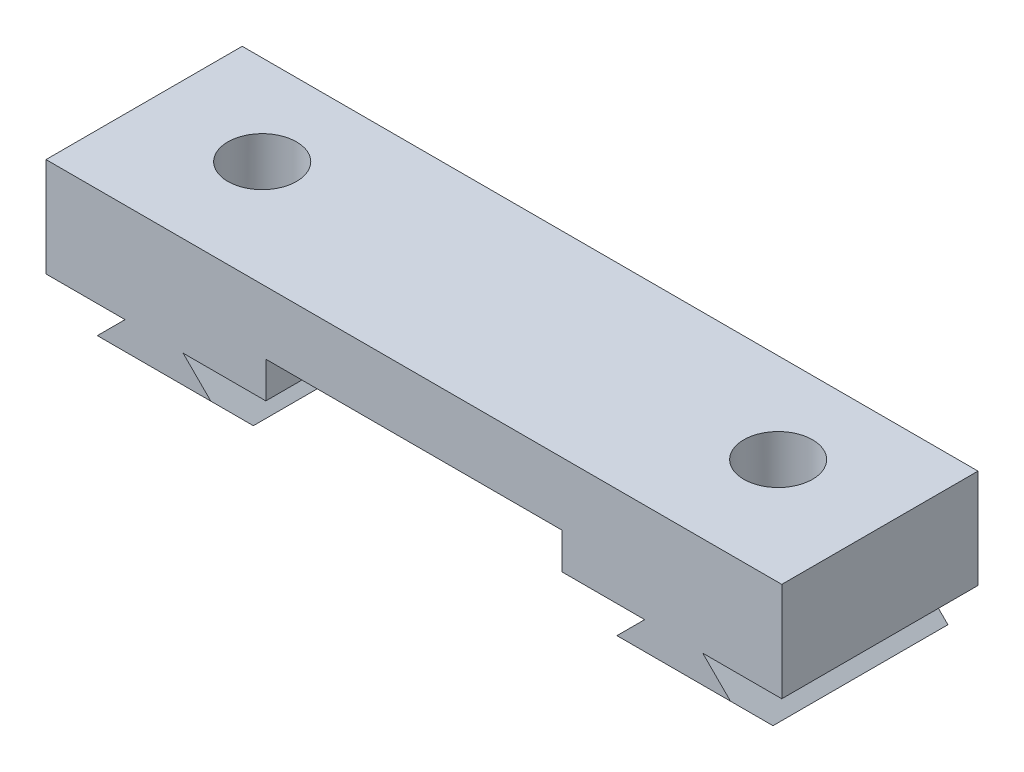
ISO-10303-21;
HEADER;
FILE_DESCRIPTION(('STEP AP214'),'2;1');
FILE_NAME('part.step','',(''),(''),'','','');
FILE_SCHEMA(('AUTOMOTIVE_DESIGN { 1 0 10303 214 1 1 1 1 }'));
ENDSEC;
DATA;
#1=APPLICATION_CONTEXT('core data for automotive mechanical design processes');
#2=APPLICATION_PROTOCOL_DEFINITION('international standard','automotive_design',2000,#1);
#3=PRODUCT_CONTEXT('',#1,'mechanical');
#4=PRODUCT('Part','Part','',(#3));
#5=PRODUCT_RELATED_PRODUCT_CATEGORY('part','',(#4));
#6=PRODUCT_DEFINITION_FORMATION('','',#4);
#7=PRODUCT_DEFINITION_CONTEXT('part definition',#1,'design');
#8=PRODUCT_DEFINITION('design','',#6,#7);
#9=PRODUCT_DEFINITION_SHAPE('','',#8);
#10=(LENGTH_UNIT() NAMED_UNIT(*) SI_UNIT(.MILLI.,.METRE.));
#11=(NAMED_UNIT(*) PLANE_ANGLE_UNIT() SI_UNIT($,.RADIAN.));
#12=(NAMED_UNIT(*) SI_UNIT($,.STERADIAN.) SOLID_ANGLE_UNIT());
#13=UNCERTAINTY_MEASURE_WITH_UNIT(LENGTH_MEASURE(1.E-05),#10,'distance_accuracy_value','');
#14=(GEOMETRIC_REPRESENTATION_CONTEXT(3) GLOBAL_UNCERTAINTY_ASSIGNED_CONTEXT((#13)) GLOBAL_UNIT_ASSIGNED_CONTEXT((#10,
#11,#12)) REPRESENTATION_CONTEXT('',''));
#15=CARTESIAN_POINT('',(0.,0.,0.));
#16=DIRECTION('',(0.,0.,1.));
#17=DIRECTION('',(1.,0.,0.));
#18=AXIS2_PLACEMENT_3D('',#15,#16,#17);
#19=CARTESIAN_POINT('',(-22.5,3.85,77.5));
#20=DIRECTION('',(0.,0.,-1.));
#21=DIRECTION('',(-1.,0.,0.));
#22=AXIS2_PLACEMENT_3D('',#19,#20,#21);
#23=PLANE('',#22);
#24=DIRECTION('',(1.,0.,0.));
#25=VECTOR('',#24,1.);
#26=CARTESIAN_POINT('',(0.,-2.21000000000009,77.5));
#27=LINE('',#26,#25);
#28=CARTESIAN_POINT('',(9.05487804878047,-2.20999999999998,77.5));
#29=VERTEX_POINT('',#28);
#30=CARTESIAN_POINT('',(14.1149885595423,-2.20999999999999,77.5));
#31=VERTEX_POINT('',#30);
#32=EDGE_CURVE('E266',#29,#31,#27,.T.);
#33=ORIENTED_EDGE('',*,*,#32,.T.);
#34=DIRECTION('',(0.707106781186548,0.707106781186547,0.));
#35=VECTOR('',#34,1.);
#36=CARTESIAN_POINT('',(14.1149885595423,-2.20999999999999,77.5));
#37=LINE('',#36,#35);
#38=CARTESIAN_POINT('',(12.4182904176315,-3.90669814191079,77.5));
#39=VERTEX_POINT('',#38);
#40=EDGE_CURVE('E283',#39,#31,#37,.T.);
#41=ORIENTED_EDGE('',*,*,#40,.F.);
#42=DIRECTION('',(1.,0.,0.));
#43=VECTOR('',#42,1.);
#44=CARTESIAN_POINT('',(21.7245960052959,-3.90669814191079,77.5));
#45=LINE('',#44,#43);
#46=CARTESIAN_POINT('',(19.3611836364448,-3.90669814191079,77.5));
#47=VERTEX_POINT('',#46);
#48=EDGE_CURVE('E419',#39,#47,#45,.T.);
#49=ORIENTED_EDGE('',*,*,#48,.T.);
#50=DIRECTION('',(0.707106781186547,-0.707106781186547,0.));
#51=VECTOR('',#50,1.);
#52=CARTESIAN_POINT('',(17.664485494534,-2.20999999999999,77.5));
#53=LINE('',#52,#51);
#54=CARTESIAN_POINT('',(17.664485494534,-2.20999999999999,77.5));
#55=VERTEX_POINT('',#54);
#56=EDGE_CURVE('E288',#55,#47,#53,.T.);
#57=ORIENTED_EDGE('',*,*,#56,.F.);
#58=DIRECTION('',(1.,0.,0.));
#59=VECTOR('',#58,1.);
#60=CARTESIAN_POINT('',(0.,-2.21,77.5));
#61=LINE('',#60,#59);
#62=CARTESIAN_POINT('',(22.5,-2.21,77.5));
#63=VERTEX_POINT('',#62);
#64=EDGE_CURVE('E343',#55,#63,#61,.T.);
#65=ORIENTED_EDGE('',*,*,#64,.T.);
#66=DIRECTION('',(0.,-1.,0.));
#67=VECTOR('',#66,1.);
#68=CARTESIAN_POINT('',(22.5,3.85,77.5));
#69=LINE('',#68,#67);
#70=CARTESIAN_POINT('',(22.5,3.85,77.5));
#71=VERTEX_POINT('',#70);
#72=EDGE_CURVE('E409',#71,#63,#69,.T.);
#73=ORIENTED_EDGE('',*,*,#72,.F.);
#74=DIRECTION('',(1.,0.,0.));
#75=VECTOR('',#74,1.);
#76=CARTESIAN_POINT('',(-22.5,3.85,77.5));
#77=LINE('',#76,#75);
#78=CARTESIAN_POINT('',(-22.5,3.85,77.5));
#79=VERTEX_POINT('',#78);
#80=EDGE_CURVE('E127',#79,#71,#77,.T.);
#81=ORIENTED_EDGE('',*,*,#80,.F.);
#82=DIRECTION('',(0.,-1.,0.));
#83=VECTOR('',#82,1.);
#84=CARTESIAN_POINT('',(-22.5,3.85,77.5));
#85=LINE('',#84,#83);
#86=CARTESIAN_POINT('',(-22.5,-2.20999999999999,77.5));
#87=VERTEX_POINT('',#86);
#88=EDGE_CURVE('E412',#79,#87,#85,.T.);
#89=ORIENTED_EDGE('',*,*,#88,.T.);
#90=DIRECTION('',(-1.,0.,0.));
#91=VECTOR('',#90,1.);
#92=CARTESIAN_POINT('',(0.,-2.21,77.5));
#93=LINE('',#92,#91);
#94=CARTESIAN_POINT('',(-17.664485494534,-2.20999999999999,77.5));
#95=VERTEX_POINT('',#94);
#96=EDGE_CURVE('E119',#95,#87,#93,.T.);
#97=ORIENTED_EDGE('',*,*,#96,.F.);
#98=DIRECTION('',(0.707106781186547,0.707106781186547,0.));
#99=VECTOR('',#98,1.);
#100=CARTESIAN_POINT('',(-17.664485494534,-2.20999999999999,77.5));
#101=LINE('',#100,#99);
#102=CARTESIAN_POINT('',(-19.3611836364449,-3.90669814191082,77.5));
#103=VERTEX_POINT('',#102);
#104=EDGE_CURVE('E308',#103,#95,#101,.T.);
#105=ORIENTED_EDGE('',*,*,#104,.F.);
#106=DIRECTION('',(1.,0.,0.));
#107=VECTOR('',#106,1.);
#108=CARTESIAN_POINT('',(-10.0548780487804,-3.90669814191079,77.5));
#109=LINE('',#108,#107);
#110=CARTESIAN_POINT('',(-12.4182904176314,-3.90669814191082,77.5));
#111=VERTEX_POINT('',#110);
#112=EDGE_CURVE('E416',#103,#111,#109,.T.);
#113=ORIENTED_EDGE('',*,*,#112,.T.);
#114=DIRECTION('',(0.707106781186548,-0.707106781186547,0.));
#115=VECTOR('',#114,1.);
#116=CARTESIAN_POINT('',(-14.1149885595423,-2.20999999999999,77.5));
#117=LINE('',#116,#115);
#118=CARTESIAN_POINT('',(-14.1149885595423,-2.20999999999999,77.5));
#119=VERTEX_POINT('',#118);
#120=EDGE_CURVE('E313',#119,#111,#117,.T.);
#121=ORIENTED_EDGE('',*,*,#120,.F.);
#122=DIRECTION('',(-1.,0.,0.));
#123=VECTOR('',#122,1.);
#124=CARTESIAN_POINT('',(0.,-2.21000000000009,77.5));
#125=LINE('',#124,#123);
#126=CARTESIAN_POINT('',(-9.0548780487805,-2.20999999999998,77.5));
#127=VERTEX_POINT('',#126);
#128=EDGE_CURVE('E359',#127,#119,#125,.T.);
#129=ORIENTED_EDGE('',*,*,#128,.F.);
#130=DIRECTION('',(0.,-1.,0.));
#131=VECTOR('',#130,1.);
#132=CARTESIAN_POINT('',(-9.05487804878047,3.85,77.5));
#133=LINE('',#132,#131);
#134=CARTESIAN_POINT('',(-9.05487804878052,0.,77.5));
#135=VERTEX_POINT('',#134);
#136=EDGE_CURVE('E373',#135,#127,#133,.T.);
#137=ORIENTED_EDGE('',*,*,#136,.F.);
#138=DIRECTION('',(-1.,0.,0.));
#139=VECTOR('',#138,1.);
#140=CARTESIAN_POINT('',(-9.05487804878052,0.,77.5));
#141=LINE('',#140,#139);
#142=CARTESIAN_POINT('',(9.05487804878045,0.,77.5));
#143=VERTEX_POINT('',#142);
#144=EDGE_CURVE('E388',#143,#135,#141,.T.);
#145=ORIENTED_EDGE('',*,*,#144,.F.);
#146=DIRECTION('',(0.,1.,0.));
#147=VECTOR('',#146,1.);
#148=CARTESIAN_POINT('',(9.05487804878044,-3.30669814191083,77.5));
#149=LINE('',#148,#147);
#150=EDGE_CURVE('E371',#29,#143,#149,.T.);
#151=ORIENTED_EDGE('',*,*,#150,.F.);
#152=EDGE_LOOP('',(#33,#41,#49,#57,#65,#73,#81,#89,#97,#105,#113,#121,#129,#137,#145,#151));
#153=FACE_BOUND('',#152,.T.);
#154=ADVANCED_FACE('F104',(#153),#23,.F.);
#155=CARTESIAN_POINT('',(22.5,7.58552377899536,65.5));
#156=DIRECTION('',(0.,0.,1.));
#157=DIRECTION('',(1.,0.,0.));
#158=AXIS2_PLACEMENT_3D('',#155,#156,#157);
#159=PLANE('',#158);
#160=DIRECTION('',(0.707106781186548,0.707106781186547,0.));
#161=VECTOR('',#160,1.);
#162=CARTESIAN_POINT('',(14.1149885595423,-2.20999999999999,65.5));
#163=LINE('',#162,#161);
#164=CARTESIAN_POINT('',(11.1182904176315,-5.2066981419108,65.5));
#165=VERTEX_POINT('',#164);
#166=CARTESIAN_POINT('',(14.1149885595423,-2.20999999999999,65.5));
#167=VERTEX_POINT('',#166);
#168=EDGE_CURVE('E285',#165,#167,#163,.T.);
#169=ORIENTED_EDGE('',*,*,#168,.T.);
#170=DIRECTION('',(1.,0.,0.));
#171=VECTOR('',#170,1.);
#172=CARTESIAN_POINT('',(0.,-2.21000000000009,65.5));
#173=LINE('',#172,#171);
#174=CARTESIAN_POINT('',(9.05487804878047,-2.20999999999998,65.5));
#175=VERTEX_POINT('',#174);
#176=EDGE_CURVE('E265',#175,#167,#173,.T.);
#177=ORIENTED_EDGE('',*,*,#176,.F.);
#178=DIRECTION('',(0.,1.,0.));
#179=VECTOR('',#178,1.);
#180=CARTESIAN_POINT('',(9.05487804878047,3.85,65.5));
#181=LINE('',#180,#179);
#182=CARTESIAN_POINT('',(9.05487804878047,0.,65.5));
#183=VERTEX_POINT('',#182);
#184=EDGE_CURVE('E378',#175,#183,#181,.T.);
#185=ORIENTED_EDGE('',*,*,#184,.T.);
#186=DIRECTION('',(1.,0.,0.));
#187=VECTOR('',#186,1.);
#188=CARTESIAN_POINT('',(-9.05487804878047,0.,65.5));
#189=LINE('',#188,#187);
#190=CARTESIAN_POINT('',(-9.05487804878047,0.,65.5));
#191=VERTEX_POINT('',#190);
#192=EDGE_CURVE('E367',#191,#183,#189,.T.);
#193=ORIENTED_EDGE('',*,*,#192,.F.);
#194=DIRECTION('',(0.,-1.,0.));
#195=VECTOR('',#194,1.);
#196=CARTESIAN_POINT('',(-9.05487804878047,3.85,65.5));
#197=LINE('',#196,#195);
#198=CARTESIAN_POINT('',(-9.05487804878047,-2.20999999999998,65.5));
#199=VERTEX_POINT('',#198);
#200=EDGE_CURVE('E385',#191,#199,#197,.T.);
#201=ORIENTED_EDGE('',*,*,#200,.T.);
#202=DIRECTION('',(-1.,0.,0.));
#203=VECTOR('',#202,1.);
#204=CARTESIAN_POINT('',(0.,-2.21000000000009,65.5));
#205=LINE('',#204,#203);
#206=CARTESIAN_POINT('',(-14.1149885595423,-2.20999999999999,65.5));
#207=VERTEX_POINT('',#206);
#208=EDGE_CURVE('E358',#199,#207,#205,.T.);
#209=ORIENTED_EDGE('',*,*,#208,.T.);
#210=DIRECTION('',(0.707106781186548,-0.707106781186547,0.));
#211=VECTOR('',#210,1.);
#212=CARTESIAN_POINT('',(-14.1149885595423,-2.20999999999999,65.5));
#213=LINE('',#212,#211);
#214=CARTESIAN_POINT('',(-11.1182904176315,-5.2066981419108,65.5));
#215=VERTEX_POINT('',#214);
#216=EDGE_CURVE('E316',#207,#215,#213,.T.);
#217=ORIENTED_EDGE('',*,*,#216,.T.);
#218=DIRECTION('',(-1.,0.,0.));
#219=VECTOR('',#218,1.);
#220=CARTESIAN_POINT('',(-20.6611836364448,-5.2066981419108,65.5));
#221=LINE('',#220,#219);
#222=CARTESIAN_POINT('',(-20.6611836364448,-5.2066981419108,65.5));
#223=VERTEX_POINT('',#222);
#224=EDGE_CURVE('E309',#215,#223,#221,.T.);
#225=ORIENTED_EDGE('',*,*,#224,.T.);
#226=DIRECTION('',(0.707106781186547,0.707106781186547,0.));
#227=VECTOR('',#226,1.);
#228=CARTESIAN_POINT('',(-17.664485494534,-2.20999999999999,65.5));
#229=LINE('',#228,#227);
#230=CARTESIAN_POINT('',(-17.664485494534,-2.20999999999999,65.5));
#231=VERTEX_POINT('',#230);
#232=EDGE_CURVE('E312',#223,#231,#229,.T.);
#233=ORIENTED_EDGE('',*,*,#232,.T.);
#234=DIRECTION('',(-1.,0.,0.));
#235=VECTOR('',#234,1.);
#236=CARTESIAN_POINT('',(0.,-2.21,65.5));
#237=LINE('',#236,#235);
#238=CARTESIAN_POINT('',(-22.5,-2.21,65.5));
#239=VERTEX_POINT('',#238);
#240=EDGE_CURVE('E355',#231,#239,#237,.T.);
#241=ORIENTED_EDGE('',*,*,#240,.T.);
#242=DIRECTION('',(0.,1.,0.));
#243=VECTOR('',#242,1.);
#244=CARTESIAN_POINT('',(-22.5,7.58552377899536,65.5));
#245=LINE('',#244,#243);
#246=CARTESIAN_POINT('',(-22.5,3.85,65.5));
#247=VERTEX_POINT('',#246);
#248=EDGE_CURVE('E376',#239,#247,#245,.T.);
#249=ORIENTED_EDGE('',*,*,#248,.T.);
#250=DIRECTION('',(-1.,0.,0.));
#251=VECTOR('',#250,1.);
#252=CARTESIAN_POINT('',(0.,3.85,65.5));
#253=LINE('',#252,#251);
#254=CARTESIAN_POINT('',(22.5,3.85,65.5));
#255=VERTEX_POINT('',#254);
#256=EDGE_CURVE('E381',#255,#247,#253,.T.);
#257=ORIENTED_EDGE('',*,*,#256,.F.);
#258=DIRECTION('',(0.,1.,0.));
#259=VECTOR('',#258,1.);
#260=CARTESIAN_POINT('',(22.5,7.58552377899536,65.5));
#261=LINE('',#260,#259);
#262=CARTESIAN_POINT('',(22.5,-2.21,65.5));
#263=VERTEX_POINT('',#262);
#264=EDGE_CURVE('E262',#263,#255,#261,.T.);
#265=ORIENTED_EDGE('',*,*,#264,.F.);
#266=DIRECTION('',(1.,0.,0.));
#267=VECTOR('',#266,1.);
#268=CARTESIAN_POINT('',(0.,-2.21,65.5));
#269=LINE('',#268,#267);
#270=CARTESIAN_POINT('',(17.664485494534,-2.20999999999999,65.5));
#271=VERTEX_POINT('',#270);
#272=EDGE_CURVE('E254',#271,#263,#269,.T.);
#273=ORIENTED_EDGE('',*,*,#272,.F.);
#274=DIRECTION('',(0.707106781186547,-0.707106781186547,0.));
#275=VECTOR('',#274,1.);
#276=CARTESIAN_POINT('',(17.664485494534,-2.20999999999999,65.5));
#277=LINE('',#276,#275);
#278=CARTESIAN_POINT('',(20.6611836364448,-5.2066981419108,65.5));
#279=VERTEX_POINT('',#278);
#280=EDGE_CURVE('E260',#271,#279,#277,.T.);
#281=ORIENTED_EDGE('',*,*,#280,.T.);
#282=DIRECTION('',(-1.,0.,0.));
#283=VECTOR('',#282,1.);
#284=CARTESIAN_POINT('',(20.6611836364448,-5.2066981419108,65.5));
#285=LINE('',#284,#283);
#286=EDGE_CURVE('E282',#279,#165,#285,.T.);
#287=ORIENTED_EDGE('',*,*,#286,.T.);
#288=EDGE_LOOP('',(#169,#177,#185,#193,#201,#209,#217,#225,#233,#241,#249,#257,#265,#273,#281,#287));
#289=FACE_BOUND('',#288,.T.);
#290=ADVANCED_FACE('F257',(#289),#159,.F.);
#291=CARTESIAN_POINT('',(9.05487804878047,3.85,71.));
#292=DIRECTION('',(-1.,0.,0.));
#293=DIRECTION('',(0.,0.,1.));
#294=AXIS2_PLACEMENT_3D('',#291,#292,#293);
#295=PLANE('',#294);
#296=ORIENTED_EDGE('',*,*,#184,.F.);
#297=DIRECTION('',(0.,0.,1.));
#298=VECTOR('',#297,1.);
#299=CARTESIAN_POINT('',(9.05487804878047,-2.20999999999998,71.));
#300=LINE('',#299,#298);
#301=EDGE_CURVE('E346',#175,#29,#300,.T.);
#302=ORIENTED_EDGE('',*,*,#301,.T.);
#303=ORIENTED_EDGE('',*,*,#150,.T.);
#304=DIRECTION('',(0.,0.,1.));
#305=VECTOR('',#304,1.);
#306=CARTESIAN_POINT('',(9.05487804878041,0.,-77.5));
#307=LINE('',#306,#305);
#308=EDGE_CURVE('E391',#183,#143,#307,.T.);
#309=ORIENTED_EDGE('',*,*,#308,.F.);
#310=EDGE_LOOP('',(#296,#302,#303,#309));
#311=FACE_BOUND('',#310,.T.);
#312=ADVANCED_FACE('F482',(#311),#295,.T.);
#313=CARTESIAN_POINT('',(22.5,3.85,77.5));
#314=DIRECTION('',(-1.,0.,0.));
#315=DIRECTION('',(0.,0.,1.));
#316=AXIS2_PLACEMENT_3D('',#313,#314,#315);
#317=PLANE('',#316);
#318=DIRECTION('',(0.,0.,1.));
#319=VECTOR('',#318,1.);
#320=CARTESIAN_POINT('',(22.5,-2.21,77.5));
#321=LINE('',#320,#319);
#322=EDGE_CURVE('E353',#263,#63,#321,.T.);
#323=ORIENTED_EDGE('',*,*,#322,.F.);
#324=ORIENTED_EDGE('',*,*,#264,.T.);
#325=DIRECTION('',(0.,0.,-1.));
#326=VECTOR('',#325,1.);
#327=CARTESIAN_POINT('',(22.5,3.85,77.5));
#328=LINE('',#327,#326);
#329=EDGE_CURVE('E403',#71,#255,#328,.T.);
#330=ORIENTED_EDGE('',*,*,#329,.F.);
#331=ORIENTED_EDGE('',*,*,#72,.T.);
#332=EDGE_LOOP('',(#323,#324,#330,#331));
#333=FACE_BOUND('',#332,.T.);
#334=ADVANCED_FACE('F489',(#333),#317,.F.);
#335=CARTESIAN_POINT('',(10.0548780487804,-5.3066981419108,76.1));
#336=DIRECTION('',(0.,-0.707106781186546,0.707106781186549));
#337=DIRECTION('',(1.,0.,0.));
#338=AXIS2_PLACEMENT_3D('',#335,#336,#337);
#339=PLANE('',#338);
#340=DIRECTION('',(0.577350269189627,0.577350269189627,0.577350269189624));
#341=VECTOR('',#340,1.);
#342=CARTESIAN_POINT('',(10.6971529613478,-5.62783559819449,75.7788625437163));
#343=LINE('',#342,#341);
#344=CARTESIAN_POINT('',(11.1182904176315,-5.2066981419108,76.2));
#345=VERTEX_POINT('',#344);
#346=EDGE_CURVE('E306',#345,#39,#343,.T.);
#347=ORIENTED_EDGE('',*,*,#346,.F.);
#348=DIRECTION('',(-1.,0.,0.));
#349=VECTOR('',#348,1.);
#350=CARTESIAN_POINT('',(10.0548780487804,-5.2066981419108,76.2));
#351=LINE('',#350,#349);
#352=CARTESIAN_POINT('',(20.6611836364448,-5.2066981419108,76.2));
#353=VERTEX_POINT('',#352);
#354=EDGE_CURVE('E304',#353,#345,#351,.T.);
#355=ORIENTED_EDGE('',*,*,#354,.F.);
#356=DIRECTION('',(0.577350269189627,-0.577350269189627,-0.577350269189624));
#357=VECTOR('',#356,1.);
#358=CARTESIAN_POINT('',(17.1924151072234,-1.7379296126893,79.6687685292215));
#359=LINE('',#358,#357);
#360=EDGE_CURVE('E296',#47,#353,#359,.T.);
#361=ORIENTED_EDGE('',*,*,#360,.F.);
#362=ORIENTED_EDGE('',*,*,#48,.F.);
#363=EDGE_LOOP('',(#347,#355,#361,#362));
#364=FACE_BOUND('',#363,.T.);
#365=ADVANCED_FACE('F445',(#364),#339,.T.);
#366=CARTESIAN_POINT('',(15.7774390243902,3.85,71.));
#367=DIRECTION('',(0.,-1.,0.));
#368=DIRECTION('',(0.,0.,-1.));
#369=AXIS2_PLACEMENT_3D('',#366,#367,#368);
#370=CYLINDRICAL_SURFACE('',#369,2.1);
#371=CARTESIAN_POINT('',(15.7774390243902,-2.20999999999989,71.));
#372=DIRECTION('',(0.,-1.,0.));
#373=DIRECTION('',(1.,0.,0.));
#374=AXIS2_PLACEMENT_3D('',#371,#372,#373);
#375=CIRCLE('',#374,2.1);
#376=CARTESIAN_POINT('',(14.1149885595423,-2.20999999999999,72.2830660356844));
#377=VERTEX_POINT('',#376);
#378=CARTESIAN_POINT('',(14.1149885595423,-2.20999999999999,69.7169339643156));
#379=VERTEX_POINT('',#378);
#380=EDGE_CURVE('E427',#377,#379,#375,.T.);
#381=ORIENTED_EDGE('',*,*,#380,.T.);
#382=CARTESIAN_POINT('',(15.7774390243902,-0.547549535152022,71.));
#383=DIRECTION('',(0.707106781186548,-0.707106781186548,0.));
#384=DIRECTION('',(-0.707106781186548,-0.707106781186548,0.));
#385=AXIS2_PLACEMENT_3D('',#382,#383,#384);
#386=ELLIPSE('',#385,2.9698484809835,2.1);
#387=EDGE_CURVE('E13',#377,#379,#386,.T.);
#388=ORIENTED_EDGE('',*,*,#387,.F.);
#389=EDGE_LOOP('',(#381,#388));
#390=FACE_BOUND('',#389,.T.);
#391=CARTESIAN_POINT('',(15.7774390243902,-5.2066981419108,71.));
#392=DIRECTION('',(0.,1.,0.));
#393=DIRECTION('',(-1.,0.,0.));
#394=AXIS2_PLACEMENT_3D('',#391,#392,#393);
#395=CIRCLE('',#394,2.1);
#396=CARTESIAN_POINT('',(13.6774390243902,-5.2066981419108,71.));
#397=VERTEX_POINT('',#396);
#398=EDGE_CURVE('E303',#397,#397,#395,.T.);
#399=ORIENTED_EDGE('',*,*,#398,.F.);
#400=EDGE_LOOP('',(#399));
#401=FACE_BOUND('',#400,.T.);
#402=CARTESIAN_POINT('',(15.7774390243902,-2.21,71.));
#403=DIRECTION('',(0.,-1.,0.));
#404=DIRECTION('',(0.,0.,-1.));
#405=AXIS2_PLACEMENT_3D('',#402,#403,#404);
#406=CIRCLE('',#405,2.1);
#407=CARTESIAN_POINT('',(17.664485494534,-2.20999999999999,70.0785578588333));
#408=VERTEX_POINT('',#407);
#409=CARTESIAN_POINT('',(17.664485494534,-2.20999999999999,71.9214421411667));
#410=VERTEX_POINT('',#409);
#411=EDGE_CURVE('E272',#408,#410,#406,.T.);
#412=ORIENTED_EDGE('',*,*,#411,.T.);
#413=CARTESIAN_POINT('',(15.7774390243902,-0.322953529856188,71.));
#414=DIRECTION('',(-0.707106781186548,-0.707106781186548,0.));
#415=DIRECTION('',(0.707106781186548,-0.707106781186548,0.));
#416=AXIS2_PLACEMENT_3D('',#413,#414,#415);
#417=ELLIPSE('',#416,2.9698484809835,2.1);
#418=EDGE_CURVE('E112',#408,#410,#417,.T.);
#419=ORIENTED_EDGE('',*,*,#418,.F.);
#420=EDGE_LOOP('',(#412,#419));
#421=FACE_BOUND('',#420,.T.);
#422=CARTESIAN_POINT('',(15.7774390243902,3.85,71.));
#423=DIRECTION('',(0.,1.,0.));
#424=DIRECTION('',(0.,0.,-1.));
#425=AXIS2_PLACEMENT_3D('',#422,#423,#424);
#426=CIRCLE('',#425,2.1);
#427=CARTESIAN_POINT('',(15.7774390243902,3.85,68.9));
#428=VERTEX_POINT('',#427);
#429=EDGE_CURVE('E399',#428,#428,#426,.T.);
#430=ORIENTED_EDGE('',*,*,#429,.T.);
#431=EDGE_LOOP('',(#430));
#432=FACE_BOUND('',#431,.T.);
#433=ADVANCED_FACE('F442',(#390,#401,#421,#432),#370,.F.);
#434=CARTESIAN_POINT('',(-10.0548780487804,-5.3066981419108,76.1));
#435=DIRECTION('',(0.,-0.707106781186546,0.707106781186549));
#436=DIRECTION('',(1.,0.,0.));
#437=AXIS2_PLACEMENT_3D('',#434,#435,#436);
#438=PLANE('',#437);
#439=DIRECTION('',(0.577350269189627,-0.577350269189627,-0.577350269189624));
#440=VECTOR('',#439,1.);
#441=CARTESIAN_POINT('',(-10.6971529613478,-5.62783559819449,75.7788625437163));
#442=LINE('',#441,#440);
#443=CARTESIAN_POINT('',(-11.1182904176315,-5.2066981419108,76.2));
#444=VERTEX_POINT('',#443);
#445=EDGE_CURVE('E339',#111,#444,#442,.T.);
#446=ORIENTED_EDGE('',*,*,#445,.F.);
#447=ORIENTED_EDGE('',*,*,#112,.F.);
#448=DIRECTION('',(0.577350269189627,0.577350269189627,0.577350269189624));
#449=VECTOR('',#448,1.);
#450=CARTESIAN_POINT('',(-17.1924151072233,-1.7379296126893,79.6687685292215));
#451=LINE('',#450,#449);
#452=CARTESIAN_POINT('',(-20.6611836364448,-5.2066981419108,76.2));
#453=VERTEX_POINT('',#452);
#454=EDGE_CURVE('E327',#453,#103,#451,.T.);
#455=ORIENTED_EDGE('',*,*,#454,.F.);
#456=DIRECTION('',(-1.,0.,0.));
#457=VECTOR('',#456,1.);
#458=CARTESIAN_POINT('',(-10.0548780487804,-5.2066981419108,76.2));
#459=LINE('',#458,#457);
#460=EDGE_CURVE('E342',#444,#453,#459,.T.);
#461=ORIENTED_EDGE('',*,*,#460,.F.);
#462=EDGE_LOOP('',(#446,#447,#455,#461));
#463=FACE_BOUND('',#462,.T.);
#464=ADVANCED_FACE('F106',(#463),#438,.T.);
#465=CARTESIAN_POINT('',(-15.7774390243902,3.85,71.));
#466=DIRECTION('',(0.,-1.,0.));
#467=DIRECTION('',(0.,0.,-1.));
#468=AXIS2_PLACEMENT_3D('',#465,#466,#467);
#469=CYLINDRICAL_SURFACE('',#468,2.1);
#470=CARTESIAN_POINT('',(-15.7774390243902,-5.2066981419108,71.));
#471=DIRECTION('',(0.,1.,0.));
#472=DIRECTION('',(-1.,0.,0.));
#473=AXIS2_PLACEMENT_3D('',#470,#471,#472);
#474=CIRCLE('',#473,2.1);
#475=CARTESIAN_POINT('',(-17.8774390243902,-5.2066981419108,71.));
#476=VERTEX_POINT('',#475);
#477=EDGE_CURVE('E341',#476,#476,#474,.T.);
#478=ORIENTED_EDGE('',*,*,#477,.F.);
#479=EDGE_LOOP('',(#478));
#480=FACE_BOUND('',#479,.T.);
#481=CARTESIAN_POINT('',(-15.7774390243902,-2.20999999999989,71.));
#482=DIRECTION('',(0.,1.,0.));
#483=DIRECTION('',(-1.,0.,0.));
#484=AXIS2_PLACEMENT_3D('',#481,#482,#483);
#485=CIRCLE('',#484,2.1);
#486=CARTESIAN_POINT('',(-14.1149885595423,-2.20999999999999,72.2830660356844));
#487=VERTEX_POINT('',#486);
#488=CARTESIAN_POINT('',(-14.1149885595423,-2.20999999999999,69.7169339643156));
#489=VERTEX_POINT('',#488);
#490=EDGE_CURVE('E424',#487,#489,#485,.T.);
#491=ORIENTED_EDGE('',*,*,#490,.F.);
#492=CARTESIAN_POINT('',(-15.7774390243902,-0.547549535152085,71.));
#493=DIRECTION('',(-0.707106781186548,-0.707106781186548,0.));
#494=DIRECTION('',(0.707106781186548,-0.707106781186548,0.));
#495=AXIS2_PLACEMENT_3D('',#492,#493,#494);
#496=ELLIPSE('',#495,2.96984848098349,2.1);
#497=EDGE_CURVE('E432',#489,#487,#496,.T.);
#498=ORIENTED_EDGE('',*,*,#497,.F.);
#499=EDGE_LOOP('',(#491,#498));
#500=FACE_BOUND('',#499,.T.);
#501=CARTESIAN_POINT('',(-15.7774390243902,-2.21,71.));
#502=DIRECTION('',(0.,1.,0.));
#503=DIRECTION('',(0.,0.,1.));
#504=AXIS2_PLACEMENT_3D('',#501,#502,#503);
#505=CIRCLE('',#504,2.1);
#506=CARTESIAN_POINT('',(-17.664485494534,-2.20999999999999,70.0785578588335));
#507=VERTEX_POINT('',#506);
#508=CARTESIAN_POINT('',(-17.664485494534,-2.20999999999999,71.9214421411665));
#509=VERTEX_POINT('',#508);
#510=EDGE_CURVE('E422',#507,#509,#505,.T.);
#511=ORIENTED_EDGE('',*,*,#510,.F.);
#512=CARTESIAN_POINT('',(-15.7774390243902,-0.322953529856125,71.));
#513=DIRECTION('',(0.707106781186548,-0.707106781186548,0.));
#514=DIRECTION('',(-0.707106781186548,-0.707106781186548,0.));
#515=AXIS2_PLACEMENT_3D('',#512,#513,#514);
#516=ELLIPSE('',#515,2.96984848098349,2.1);
#517=EDGE_CURVE('E429',#509,#507,#516,.T.);
#518=ORIENTED_EDGE('',*,*,#517,.F.);
#519=EDGE_LOOP('',(#511,#518));
#520=FACE_BOUND('',#519,.T.);
#521=CARTESIAN_POINT('',(-15.7774390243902,3.85,71.));
#522=DIRECTION('',(0.,1.,0.));
#523=DIRECTION('',(0.,0.,1.));
#524=AXIS2_PLACEMENT_3D('',#521,#522,#523);
#525=CIRCLE('',#524,2.1);
#526=CARTESIAN_POINT('',(-15.7774390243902,3.85,73.1));
#527=VERTEX_POINT('',#526);
#528=EDGE_CURVE('E394',#527,#527,#525,.T.);
#529=ORIENTED_EDGE('',*,*,#528,.T.);
#530=EDGE_LOOP('',(#529));
#531=FACE_BOUND('',#530,.T.);
#532=ADVANCED_FACE('F459',(#480,#500,#520,#531),#469,.F.);
#533=CARTESIAN_POINT('',(-9.05487804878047,3.85,71.));
#534=DIRECTION('',(1.,0.,0.));
#535=DIRECTION('',(0.,0.,-1.));
#536=AXIS2_PLACEMENT_3D('',#533,#534,#535);
#537=PLANE('',#536);
#538=DIRECTION('',(0.,0.,1.));
#539=VECTOR('',#538,1.);
#540=CARTESIAN_POINT('',(-9.05487804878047,-2.20999999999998,71.));
#541=LINE('',#540,#539);
#542=EDGE_CURVE('E365',#199,#127,#541,.T.);
#543=ORIENTED_EDGE('',*,*,#542,.F.);
#544=ORIENTED_EDGE('',*,*,#200,.F.);
#545=DIRECTION('',(0.,0.,1.));
#546=VECTOR('',#545,1.);
#547=CARTESIAN_POINT('',(-9.05487804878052,0.,-77.5));
#548=LINE('',#547,#546);
#549=EDGE_CURVE('E392',#191,#135,#548,.T.);
#550=ORIENTED_EDGE('',*,*,#549,.T.);
#551=ORIENTED_EDGE('',*,*,#136,.T.);
#552=EDGE_LOOP('',(#543,#544,#550,#551));
#553=FACE_BOUND('',#552,.T.);
#554=ADVANCED_FACE('F461',(#553),#537,.T.);
#555=CARTESIAN_POINT('',(-22.5,3.85,77.5));
#556=DIRECTION('',(1.,0.,0.));
#557=DIRECTION('',(0.,0.,-1.));
#558=AXIS2_PLACEMENT_3D('',#555,#556,#557);
#559=PLANE('',#558);
#560=ORIENTED_EDGE('',*,*,#248,.F.);
#561=DIRECTION('',(0.,0.,1.));
#562=VECTOR('',#561,1.);
#563=CARTESIAN_POINT('',(-22.5,-2.21,77.5));
#564=LINE('',#563,#562);
#565=EDGE_CURVE('E361',#239,#87,#564,.T.);
#566=ORIENTED_EDGE('',*,*,#565,.T.);
#567=ORIENTED_EDGE('',*,*,#88,.F.);
#568=DIRECTION('',(0.,0.,1.));
#569=VECTOR('',#568,1.);
#570=CARTESIAN_POINT('',(-22.5,3.85,77.5));
#571=LINE('',#570,#569);
#572=EDGE_CURVE('E406',#247,#79,#571,.T.);
#573=ORIENTED_EDGE('',*,*,#572,.F.);
#574=EDGE_LOOP('',(#560,#566,#567,#573));
#575=FACE_BOUND('',#574,.T.);
#576=ADVANCED_FACE('F455',(#575),#559,.F.);
#577=CARTESIAN_POINT('',(0.,3.85,0.));
#578=DIRECTION('',(0.,-1.,0.));
#579=DIRECTION('',(0.,0.,-1.));
#580=AXIS2_PLACEMENT_3D('',#577,#578,#579);
#581=PLANE('',#580);
#582=ORIENTED_EDGE('',*,*,#256,.T.);
#583=ORIENTED_EDGE('',*,*,#572,.T.);
#584=ORIENTED_EDGE('',*,*,#80,.T.);
#585=ORIENTED_EDGE('',*,*,#329,.T.);
#586=EDGE_LOOP('',(#582,#583,#584,#585));
#587=FACE_BOUND('',#586,.T.);
#588=ORIENTED_EDGE('',*,*,#429,.F.);
#589=EDGE_LOOP('',(#588));
#590=FACE_BOUND('',#589,.T.);
#591=ORIENTED_EDGE('',*,*,#528,.F.);
#592=EDGE_LOOP('',(#591));
#593=FACE_BOUND('',#592,.T.);
#594=ADVANCED_FACE('F451',(#587,#590,#593),#581,.F.);
#595=CARTESIAN_POINT('',(-9.05487804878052,0.,-77.5));
#596=DIRECTION('',(0.,1.,0.));
#597=DIRECTION('',(0.,0.,1.));
#598=AXIS2_PLACEMENT_3D('',#595,#596,#597);
#599=PLANE('',#598);
#600=ORIENTED_EDGE('',*,*,#549,.F.);
#601=ORIENTED_EDGE('',*,*,#192,.T.);
#602=ORIENTED_EDGE('',*,*,#308,.T.);
#603=ORIENTED_EDGE('',*,*,#144,.T.);
#604=EDGE_LOOP('',(#600,#601,#602,#603));
#605=FACE_BOUND('',#604,.T.);
#606=ADVANCED_FACE('F454',(#605),#599,.F.);
#607=CARTESIAN_POINT('',(0.,-2.21,65.5));
#608=DIRECTION('',(0.,1.,0.));
#609=DIRECTION('',(0.,0.,1.));
#610=AXIS2_PLACEMENT_3D('',#607,#608,#609);
#611=PLANE('',#610);
#612=ORIENTED_EDGE('',*,*,#240,.F.);
#613=DIRECTION('',(0.,0.,1.));
#614=VECTOR('',#613,1.);
#615=CARTESIAN_POINT('',(-17.664485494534,-2.20999999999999,65.5));
#616=LINE('',#615,#614);
#617=EDGE_CURVE('E332',#231,#507,#616,.T.);
#618=ORIENTED_EDGE('',*,*,#617,.T.);
#619=ORIENTED_EDGE('',*,*,#510,.T.);
#620=EDGE_CURVE('E335',#509,#95,#616,.T.);
#621=ORIENTED_EDGE('',*,*,#620,.T.);
#622=ORIENTED_EDGE('',*,*,#96,.T.);
#623=ORIENTED_EDGE('',*,*,#565,.F.);
#624=EDGE_LOOP('',(#612,#618,#619,#621,#622,#623));
#625=FACE_BOUND('',#624,.T.);
#626=ADVANCED_FACE('F551',(#625),#611,.F.);
#627=CARTESIAN_POINT('',(0.,-2.21000000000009,65.5));
#628=DIRECTION('',(0.,1.,0.));
#629=DIRECTION('',(-1.,0.,0.));
#630=AXIS2_PLACEMENT_3D('',#627,#628,#629);
#631=PLANE('',#630);
#632=ORIENTED_EDGE('',*,*,#542,.T.);
#633=ORIENTED_EDGE('',*,*,#128,.T.);
#634=DIRECTION('',(0.,0.,1.));
#635=VECTOR('',#634,1.);
#636=CARTESIAN_POINT('',(-14.1149885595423,-2.20999999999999,65.5));
#637=LINE('',#636,#635);
#638=EDGE_CURVE('E331',#487,#119,#637,.T.);
#639=ORIENTED_EDGE('',*,*,#638,.F.);
#640=ORIENTED_EDGE('',*,*,#490,.T.);
#641=EDGE_CURVE('E328',#207,#489,#637,.T.);
#642=ORIENTED_EDGE('',*,*,#641,.F.);
#643=ORIENTED_EDGE('',*,*,#208,.F.);
#644=EDGE_LOOP('',(#632,#633,#639,#640,#642,#643));
#645=FACE_BOUND('',#644,.T.);
#646=ADVANCED_FACE('F525',(#645),#631,.F.);
#647=CARTESIAN_POINT('',(0.,-2.21,65.5));
#648=DIRECTION('',(0.,-1.,0.));
#649=DIRECTION('',(0.,0.,-1.));
#650=AXIS2_PLACEMENT_3D('',#647,#648,#649);
#651=PLANE('',#650);
#652=ORIENTED_EDGE('',*,*,#322,.T.);
#653=ORIENTED_EDGE('',*,*,#64,.F.);
#654=DIRECTION('',(0.,0.,1.));
#655=VECTOR('',#654,1.);
#656=CARTESIAN_POINT('',(17.664485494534,-2.20999999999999,65.5));
#657=LINE('',#656,#655);
#658=EDGE_CURVE('E277',#410,#55,#657,.T.);
#659=ORIENTED_EDGE('',*,*,#658,.F.);
#660=ORIENTED_EDGE('',*,*,#411,.F.);
#661=EDGE_CURVE('E269',#271,#408,#657,.T.);
#662=ORIENTED_EDGE('',*,*,#661,.F.);
#663=ORIENTED_EDGE('',*,*,#272,.T.);
#664=EDGE_LOOP('',(#652,#653,#659,#660,#662,#663));
#665=FACE_BOUND('',#664,.T.);
#666=ADVANCED_FACE('F270',(#665),#651,.T.);
#667=CARTESIAN_POINT('',(0.,-2.21000000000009,65.5));
#668=DIRECTION('',(0.,-1.,0.));
#669=DIRECTION('',(1.,0.,0.));
#670=AXIS2_PLACEMENT_3D('',#667,#668,#669);
#671=PLANE('',#670);
#672=ORIENTED_EDGE('',*,*,#176,.T.);
#673=DIRECTION('',(0.,0.,1.));
#674=VECTOR('',#673,1.);
#675=CARTESIAN_POINT('',(14.1149885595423,-2.20999999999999,65.5));
#676=LINE('',#675,#674);
#677=EDGE_CURVE('E293',#167,#379,#676,.T.);
#678=ORIENTED_EDGE('',*,*,#677,.T.);
#679=ORIENTED_EDGE('',*,*,#380,.F.);
#680=EDGE_CURVE('E297',#377,#31,#676,.T.);
#681=ORIENTED_EDGE('',*,*,#680,.T.);
#682=ORIENTED_EDGE('',*,*,#32,.F.);
#683=ORIENTED_EDGE('',*,*,#301,.F.);
#684=EDGE_LOOP('',(#672,#678,#679,#681,#682,#683));
#685=FACE_BOUND('',#684,.T.);
#686=ADVANCED_FACE('F511',(#685),#671,.T.);
#687=CARTESIAN_POINT('',(-20.6611836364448,-5.2066981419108,65.5));
#688=DIRECTION('',(0.,1.,0.));
#689=DIRECTION('',(-1.,0.,0.));
#690=AXIS2_PLACEMENT_3D('',#687,#688,#689);
#691=PLANE('',#690);
#692=ORIENTED_EDGE('',*,*,#460,.T.);
#693=DIRECTION('',(0.,0.,1.));
#694=VECTOR('',#693,1.);
#695=CARTESIAN_POINT('',(-20.6611836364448,-5.2066981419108,65.5));
#696=LINE('',#695,#694);
#697=EDGE_CURVE('E319',#223,#453,#696,.T.);
#698=ORIENTED_EDGE('',*,*,#697,.F.);
#699=ORIENTED_EDGE('',*,*,#224,.F.);
#700=DIRECTION('',(0.,0.,1.));
#701=VECTOR('',#700,1.);
#702=CARTESIAN_POINT('',(-11.1182904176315,-5.2066981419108,65.5));
#703=LINE('',#702,#701);
#704=EDGE_CURVE('E323',#215,#444,#703,.T.);
#705=ORIENTED_EDGE('',*,*,#704,.T.);
#706=EDGE_LOOP('',(#692,#698,#699,#705));
#707=FACE_BOUND('',#706,.T.);
#708=ORIENTED_EDGE('',*,*,#477,.T.);
#709=EDGE_LOOP('',(#708));
#710=FACE_BOUND('',#709,.T.);
#711=ADVANCED_FACE('F538',(#707,#710),#691,.F.);
#712=CARTESIAN_POINT('',(-14.1149885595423,-2.20999999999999,65.5));
#713=DIRECTION('',(-0.707106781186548,-0.707106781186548,0.));
#714=DIRECTION('',(0.707106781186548,-0.707106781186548,0.));
#715=AXIS2_PLACEMENT_3D('',#712,#713,#714);
#716=PLANE('',#715);
#717=ORIENTED_EDGE('',*,*,#445,.T.);
#718=ORIENTED_EDGE('',*,*,#704,.F.);
#719=ORIENTED_EDGE('',*,*,#216,.F.);
#720=ORIENTED_EDGE('',*,*,#641,.T.);
#721=ORIENTED_EDGE('',*,*,#497,.T.);
#722=ORIENTED_EDGE('',*,*,#638,.T.);
#723=ORIENTED_EDGE('',*,*,#120,.T.);
#724=EDGE_LOOP('',(#717,#718,#719,#720,#721,#722,#723));
#725=FACE_BOUND('',#724,.T.);
#726=ADVANCED_FACE('F534',(#725),#716,.F.);
#727=CARTESIAN_POINT('',(-17.664485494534,-2.20999999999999,65.5));
#728=DIRECTION('',(0.707106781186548,-0.707106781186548,0.));
#729=DIRECTION('',(0.707106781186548,0.707106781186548,0.));
#730=AXIS2_PLACEMENT_3D('',#727,#728,#729);
#731=PLANE('',#730);
#732=ORIENTED_EDGE('',*,*,#454,.T.);
#733=ORIENTED_EDGE('',*,*,#104,.T.);
#734=ORIENTED_EDGE('',*,*,#620,.F.);
#735=ORIENTED_EDGE('',*,*,#517,.T.);
#736=ORIENTED_EDGE('',*,*,#617,.F.);
#737=ORIENTED_EDGE('',*,*,#232,.F.);
#738=ORIENTED_EDGE('',*,*,#697,.T.);
#739=EDGE_LOOP('',(#732,#733,#734,#735,#736,#737,#738));
#740=FACE_BOUND('',#739,.T.);
#741=ADVANCED_FACE('F543',(#740),#731,.F.);
#742=CARTESIAN_POINT('',(14.1149885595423,-2.20999999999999,65.5));
#743=DIRECTION('',(0.707106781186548,-0.707106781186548,0.));
#744=DIRECTION('',(0.707106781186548,0.707106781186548,0.));
#745=AXIS2_PLACEMENT_3D('',#742,#743,#744);
#746=PLANE('',#745);
#747=ORIENTED_EDGE('',*,*,#346,.T.);
#748=ORIENTED_EDGE('',*,*,#40,.T.);
#749=ORIENTED_EDGE('',*,*,#680,.F.);
#750=ORIENTED_EDGE('',*,*,#387,.T.);
#751=ORIENTED_EDGE('',*,*,#677,.F.);
#752=ORIENTED_EDGE('',*,*,#168,.F.);
#753=DIRECTION('',(0.,0.,1.));
#754=VECTOR('',#753,1.);
#755=CARTESIAN_POINT('',(11.1182904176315,-5.2066981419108,65.5));
#756=LINE('',#755,#754);
#757=EDGE_CURVE('E298',#165,#345,#756,.T.);
#758=ORIENTED_EDGE('',*,*,#757,.T.);
#759=EDGE_LOOP('',(#747,#748,#749,#750,#751,#752,#758));
#760=FACE_BOUND('',#759,.T.);
#761=ADVANCED_FACE('F503',(#760),#746,.F.);
#762=CARTESIAN_POINT('',(20.6611836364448,-5.2066981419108,65.5));
#763=DIRECTION('',(0.,1.,0.));
#764=DIRECTION('',(-1.,0.,0.));
#765=AXIS2_PLACEMENT_3D('',#762,#763,#764);
#766=PLANE('',#765);
#767=ORIENTED_EDGE('',*,*,#354,.T.);
#768=ORIENTED_EDGE('',*,*,#757,.F.);
#769=ORIENTED_EDGE('',*,*,#286,.F.);
#770=DIRECTION('',(0.,0.,1.));
#771=VECTOR('',#770,1.);
#772=CARTESIAN_POINT('',(20.6611836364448,-5.2066981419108,65.5));
#773=LINE('',#772,#771);
#774=EDGE_CURVE('E276',#279,#353,#773,.T.);
#775=ORIENTED_EDGE('',*,*,#774,.T.);
#776=EDGE_LOOP('',(#767,#768,#769,#775));
#777=FACE_BOUND('',#776,.T.);
#778=ORIENTED_EDGE('',*,*,#398,.T.);
#779=EDGE_LOOP('',(#778));
#780=FACE_BOUND('',#779,.T.);
#781=ADVANCED_FACE('F440',(#777,#780),#766,.F.);
#782=CARTESIAN_POINT('',(17.664485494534,-2.20999999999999,65.5));
#783=DIRECTION('',(-0.707106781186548,-0.707106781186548,0.));
#784=DIRECTION('',(0.707106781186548,-0.707106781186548,0.));
#785=AXIS2_PLACEMENT_3D('',#782,#783,#784);
#786=PLANE('',#785);
#787=ORIENTED_EDGE('',*,*,#360,.T.);
#788=ORIENTED_EDGE('',*,*,#774,.F.);
#789=ORIENTED_EDGE('',*,*,#280,.F.);
#790=ORIENTED_EDGE('',*,*,#661,.T.);
#791=ORIENTED_EDGE('',*,*,#418,.T.);
#792=ORIENTED_EDGE('',*,*,#658,.T.);
#793=ORIENTED_EDGE('',*,*,#56,.T.);
#794=EDGE_LOOP('',(#787,#788,#789,#790,#791,#792,#793));
#795=FACE_BOUND('',#794,.T.);
#796=ADVANCED_FACE('F279',(#795),#786,.F.);
#797=CLOSED_SHELL('',(#154,#290,#312,#334,#365,#433,#464,#532,#554,#576,#594,#606,#626,#646,
#666,#686,#711,#726,#741,#761,#781,#796));
#798=MANIFOLD_SOLID_BREP('B2',#797);
#799=ADVANCED_BREP_SHAPE_REPRESENTATION('',(#18,#798),#14);
#800=SHAPE_DEFINITION_REPRESENTATION(#9,#799);
ENDSEC;
END-ISO-10303-21;
